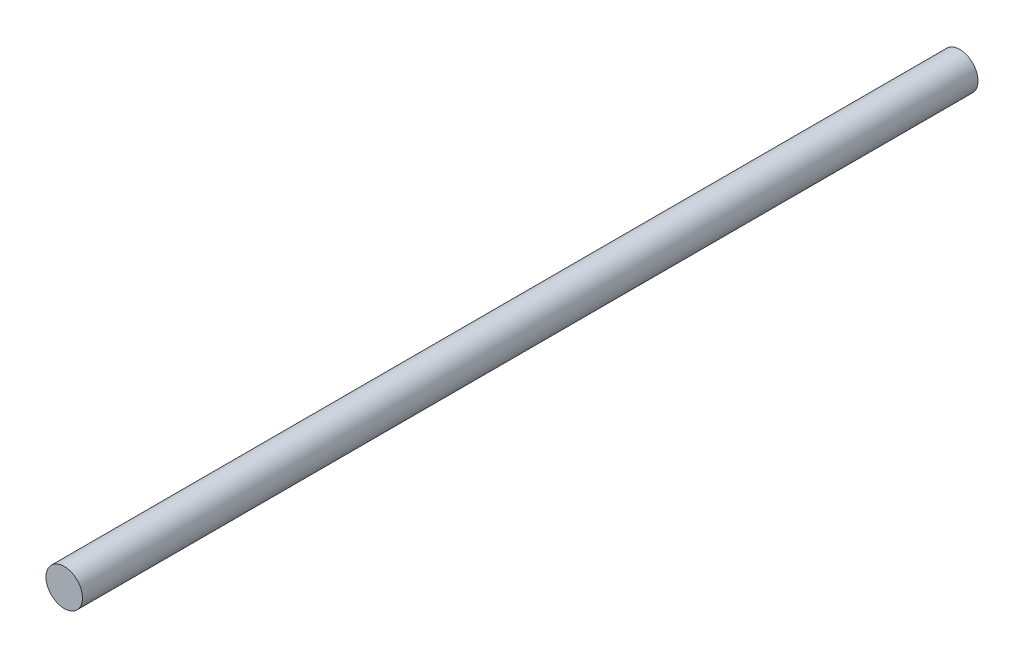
ISO-10303-21;
HEADER;
FILE_DESCRIPTION(('STEP AP214'),'2;1');
FILE_NAME('part.step','',(''),(''),'','','');
FILE_SCHEMA(('AUTOMOTIVE_DESIGN { 1 0 10303 214 1 1 1 1 }'));
ENDSEC;
DATA;
#1=APPLICATION_CONTEXT('core data for automotive mechanical design processes');
#2=APPLICATION_PROTOCOL_DEFINITION('international standard','automotive_design',2000,#1);
#3=PRODUCT_CONTEXT('',#1,'mechanical');
#4=PRODUCT('Part','Part','',(#3));
#5=PRODUCT_RELATED_PRODUCT_CATEGORY('part','',(#4));
#6=PRODUCT_DEFINITION_FORMATION('','',#4);
#7=PRODUCT_DEFINITION_CONTEXT('part definition',#1,'design');
#8=PRODUCT_DEFINITION('design','',#6,#7);
#9=PRODUCT_DEFINITION_SHAPE('','',#8);
#10=(LENGTH_UNIT() NAMED_UNIT(*) SI_UNIT(.MILLI.,.METRE.));
#11=(NAMED_UNIT(*) PLANE_ANGLE_UNIT() SI_UNIT($,.RADIAN.));
#12=(NAMED_UNIT(*) SI_UNIT($,.STERADIAN.) SOLID_ANGLE_UNIT());
#13=UNCERTAINTY_MEASURE_WITH_UNIT(LENGTH_MEASURE(1.E-05),#10,'distance_accuracy_value','');
#14=(GEOMETRIC_REPRESENTATION_CONTEXT(3) GLOBAL_UNCERTAINTY_ASSIGNED_CONTEXT((#13)) GLOBAL_UNIT_ASSIGNED_CONTEXT((#10,
#11,#12)) REPRESENTATION_CONTEXT('',''));
#15=CARTESIAN_POINT('',(0.,0.,0.));
#16=DIRECTION('',(0.,0.,1.));
#17=DIRECTION('',(1.,0.,0.));
#18=AXIS2_PLACEMENT_3D('',#15,#16,#17);
#19=CARTESIAN_POINT('',(0.,0.,736.));
#20=DIRECTION('',(0.,0.,-1.));
#21=DIRECTION('',(-1.,0.,0.));
#22=AXIS2_PLACEMENT_3D('',#19,#20,#21);
#23=CYLINDRICAL_SURFACE('',#22,15.);
#24=CARTESIAN_POINT('',(0.,0.,736.));
#25=DIRECTION('',(0.,0.,1.));
#26=DIRECTION('',(1.,0.,0.));
#27=AXIS2_PLACEMENT_3D('',#24,#25,#26);
#28=CIRCLE('',#27,15.);
#29=CARTESIAN_POINT('',(15.,0.,736.));
#30=VERTEX_POINT('',#29);
#31=EDGE_CURVE('E10',#30,#30,#28,.T.);
#32=ORIENTED_EDGE('',*,*,#31,.F.);
#33=EDGE_LOOP('',(#32));
#34=FACE_BOUND('',#33,.T.);
#35=CARTESIAN_POINT('',(0.,0.,0.));
#36=DIRECTION('',(0.,0.,1.));
#37=DIRECTION('',(1.,0.,0.));
#38=AXIS2_PLACEMENT_3D('',#35,#36,#37);
#39=CIRCLE('',#38,15.);
#40=CARTESIAN_POINT('',(15.,0.,0.));
#41=VERTEX_POINT('',#40);
#42=EDGE_CURVE('E33',#41,#41,#39,.T.);
#43=ORIENTED_EDGE('',*,*,#42,.T.);
#44=EDGE_LOOP('',(#43));
#45=FACE_BOUND('',#44,.T.);
#46=ADVANCED_FACE('F30',(#34,#45),#23,.T.);
#47=CARTESIAN_POINT('',(0.,0.,736.));
#48=DIRECTION('',(0.,0.,1.));
#49=DIRECTION('',(1.,0.,0.));
#50=AXIS2_PLACEMENT_3D('',#47,#48,#49);
#51=PLANE('',#50);
#52=ORIENTED_EDGE('',*,*,#31,.T.);
#53=EDGE_LOOP('',(#52));
#54=FACE_BOUND('',#53,.T.);
#55=ADVANCED_FACE('F45',(#54),#51,.T.);
#56=CARTESIAN_POINT('',(0.,0.,0.));
#57=DIRECTION('',(0.,0.,1.));
#58=DIRECTION('',(1.,0.,0.));
#59=AXIS2_PLACEMENT_3D('',#56,#57,#58);
#60=PLANE('',#59);
#61=ORIENTED_EDGE('',*,*,#42,.F.);
#62=EDGE_LOOP('',(#61));
#63=FACE_BOUND('',#62,.T.);
#64=ADVANCED_FACE('F43',(#63),#60,.F.);
#65=CLOSED_SHELL('',(#46,#55,#64));
#66=MANIFOLD_SOLID_BREP('B2',#65);
#67=ADVANCED_BREP_SHAPE_REPRESENTATION('',(#18,#66),#14);
#68=SHAPE_DEFINITION_REPRESENTATION(#9,#67);
ENDSEC;
END-ISO-10303-21;
